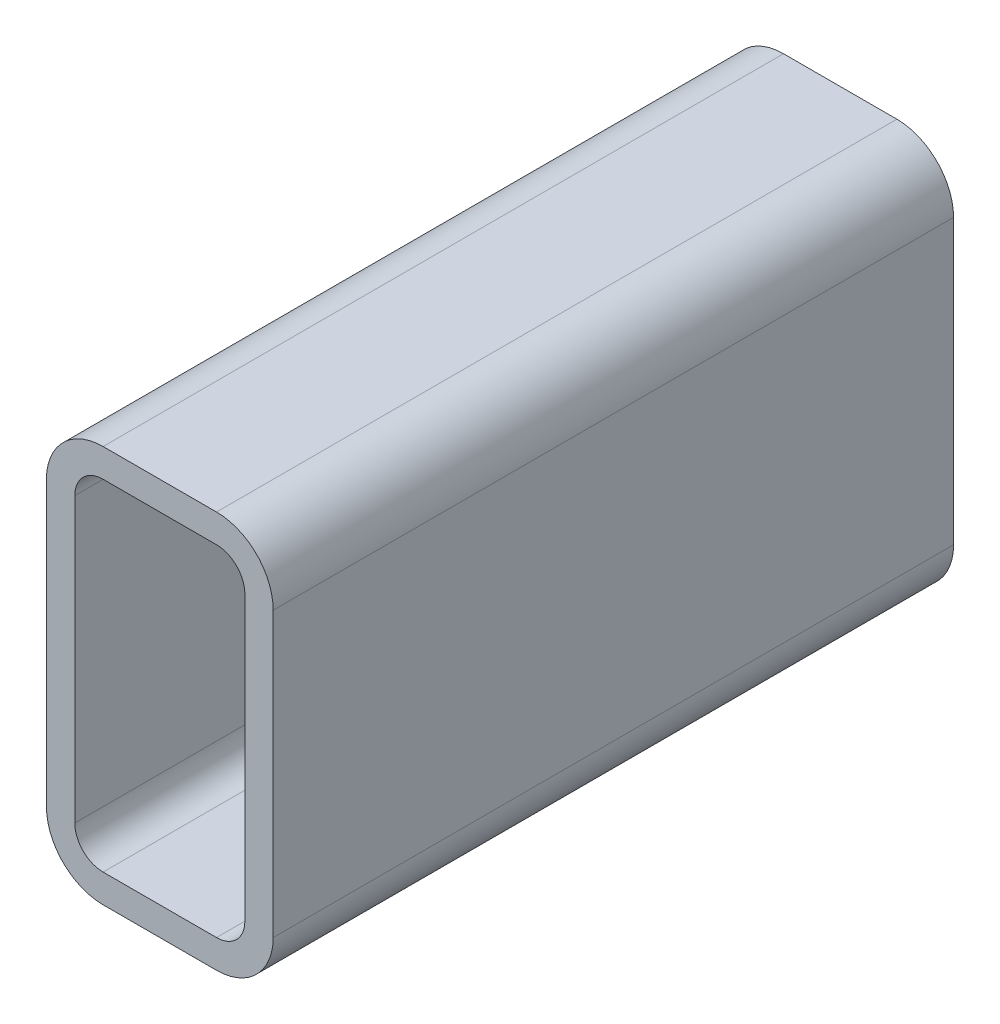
ISO-10303-21;
HEADER;
FILE_DESCRIPTION(('STEP AP214'),'2;1');
FILE_NAME('part.step','',(''),(''),'','','');
FILE_SCHEMA(('AUTOMOTIVE_DESIGN { 1 0 10303 214 1 1 1 1 }'));
ENDSEC;
DATA;
#1=APPLICATION_CONTEXT('core data for automotive mechanical design processes');
#2=APPLICATION_PROTOCOL_DEFINITION('international standard','automotive_design',2000,#1);
#3=PRODUCT_CONTEXT('',#1,'mechanical');
#4=PRODUCT('Part','Part','',(#3));
#5=PRODUCT_RELATED_PRODUCT_CATEGORY('part','',(#4));
#6=PRODUCT_DEFINITION_FORMATION('','',#4);
#7=PRODUCT_DEFINITION_CONTEXT('part definition',#1,'design');
#8=PRODUCT_DEFINITION('design','',#6,#7);
#9=PRODUCT_DEFINITION_SHAPE('','',#8);
#10=(LENGTH_UNIT() NAMED_UNIT(*) SI_UNIT(.MILLI.,.METRE.));
#11=(NAMED_UNIT(*) PLANE_ANGLE_UNIT() SI_UNIT($,.RADIAN.));
#12=(NAMED_UNIT(*) SI_UNIT($,.STERADIAN.) SOLID_ANGLE_UNIT());
#13=UNCERTAINTY_MEASURE_WITH_UNIT(LENGTH_MEASURE(1.E-05),#10,'distance_accuracy_value','');
#14=(GEOMETRIC_REPRESENTATION_CONTEXT(3) GLOBAL_UNCERTAINTY_ASSIGNED_CONTEXT((#13)) GLOBAL_UNIT_ASSIGNED_CONTEXT((#10,
#11,#12)) REPRESENTATION_CONTEXT('',''));
#15=CARTESIAN_POINT('',(0.,0.,0.));
#16=DIRECTION('',(0.,0.,1.));
#17=DIRECTION('',(1.,0.,0.));
#18=AXIS2_PLACEMENT_3D('',#15,#16,#17);
#19=CARTESIAN_POINT('',(27.0751778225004,154.389039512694,304.8));
#20=DIRECTION('',(0.,0.,1.));
#21=DIRECTION('',(1.,0.,0.));
#22=AXIS2_PLACEMENT_3D('',#19,#20,#21);
#23=PLANE('',#22);
#24=CARTESIAN_POINT('',(27.0751778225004,154.389039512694,304.8));
#25=DIRECTION('',(0.,0.,1.));
#26=DIRECTION('',(1.,0.,0.));
#27=AXIS2_PLACEMENT_3D('',#24,#25,#26);
#28=CIRCLE('',#27,25.4);
#29=CARTESIAN_POINT('',(27.0751778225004,179.789039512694,304.8));
#30=VERTEX_POINT('',#29);
#31=CARTESIAN_POINT('',(1.67517782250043,154.389039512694,304.8));
#32=VERTEX_POINT('',#31);
#33=EDGE_CURVE('E211',#30,#32,#28,.T.);
#34=ORIENTED_EDGE('',*,*,#33,.T.);
#35=DIRECTION('',(0.,-1.,0.));
#36=VECTOR('',#35,1.);
#37=CARTESIAN_POINT('',(1.67517782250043,27.3890395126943,304.8));
#38=LINE('',#37,#36);
#39=CARTESIAN_POINT('',(1.67517782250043,27.3890395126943,304.8));
#40=VERTEX_POINT('',#39);
#41=EDGE_CURVE('E214',#32,#40,#38,.T.);
#42=ORIENTED_EDGE('',*,*,#41,.T.);
#43=CARTESIAN_POINT('',(27.0751778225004,27.3890395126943,304.8));
#44=DIRECTION('',(0.,0.,1.));
#45=DIRECTION('',(1.,0.,0.));
#46=AXIS2_PLACEMENT_3D('',#43,#44,#45);
#47=CIRCLE('',#46,25.4);
#48=CARTESIAN_POINT('',(27.0751778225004,1.98903951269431,304.8));
#49=VERTEX_POINT('',#48);
#50=EDGE_CURVE('E217',#40,#49,#47,.T.);
#51=ORIENTED_EDGE('',*,*,#50,.T.);
#52=DIRECTION('',(1.,0.,0.));
#53=VECTOR('',#52,1.);
#54=CARTESIAN_POINT('',(77.8751778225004,1.98903951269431,304.8));
#55=LINE('',#54,#53);
#56=CARTESIAN_POINT('',(77.8751778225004,1.98903951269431,304.8));
#57=VERTEX_POINT('',#56);
#58=EDGE_CURVE('E219',#49,#57,#55,.T.);
#59=ORIENTED_EDGE('',*,*,#58,.T.);
#60=CARTESIAN_POINT('',(77.8751778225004,27.3890395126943,304.8));
#61=DIRECTION('',(0.,0.,1.));
#62=DIRECTION('',(1.,0.,0.));
#63=AXIS2_PLACEMENT_3D('',#60,#61,#62);
#64=CIRCLE('',#63,25.4);
#65=CARTESIAN_POINT('',(103.2751778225,27.3890395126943,304.8));
#66=VERTEX_POINT('',#65);
#67=EDGE_CURVE('E221',#57,#66,#64,.T.);
#68=ORIENTED_EDGE('',*,*,#67,.T.);
#69=DIRECTION('',(0.,1.,0.));
#70=VECTOR('',#69,1.);
#71=CARTESIAN_POINT('',(103.2751778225,154.389039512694,304.8));
#72=LINE('',#71,#70);
#73=CARTESIAN_POINT('',(103.2751778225,154.389039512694,304.8));
#74=VERTEX_POINT('',#73);
#75=EDGE_CURVE('E223',#66,#74,#72,.T.);
#76=ORIENTED_EDGE('',*,*,#75,.T.);
#77=CARTESIAN_POINT('',(77.8751778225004,154.389039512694,304.8));
#78=DIRECTION('',(0.,0.,1.));
#79=DIRECTION('',(1.,0.,0.));
#80=AXIS2_PLACEMENT_3D('',#77,#78,#79);
#81=CIRCLE('',#80,25.4);
#82=CARTESIAN_POINT('',(77.8751778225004,179.789039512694,304.8));
#83=VERTEX_POINT('',#82);
#84=EDGE_CURVE('E225',#74,#83,#81,.T.);
#85=ORIENTED_EDGE('',*,*,#84,.T.);
#86=DIRECTION('',(-1.,0.,0.));
#87=VECTOR('',#86,1.);
#88=CARTESIAN_POINT('',(27.0751778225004,179.789039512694,304.8));
#89=LINE('',#88,#87);
#90=EDGE_CURVE('E227',#83,#30,#89,.T.);
#91=ORIENTED_EDGE('',*,*,#90,.T.);
#92=EDGE_LOOP('',(#34,#42,#51,#59,#68,#76,#85,#91));
#93=FACE_BOUND('',#92,.T.);
#94=DIRECTION('',(0.,-1.,0.));
#95=VECTOR('',#94,1.);
#96=CARTESIAN_POINT('',(14.3751778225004,27.3890395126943,304.8));
#97=LINE('',#96,#95);
#98=CARTESIAN_POINT('',(14.3751778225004,154.389039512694,304.8));
#99=VERTEX_POINT('',#98);
#100=CARTESIAN_POINT('',(14.3751778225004,27.3890395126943,304.8));
#101=VERTEX_POINT('',#100);
#102=EDGE_CURVE('E154',#99,#101,#97,.T.);
#103=ORIENTED_EDGE('',*,*,#102,.F.);
#104=CARTESIAN_POINT('',(27.0751778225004,154.389039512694,304.8));
#105=DIRECTION('',(0.,0.,1.));
#106=DIRECTION('',(1.,0.,0.));
#107=AXIS2_PLACEMENT_3D('',#104,#105,#106);
#108=CIRCLE('',#107,12.7);
#109=CARTESIAN_POINT('',(27.0751778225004,167.089039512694,304.8));
#110=VERTEX_POINT('',#109);
#111=EDGE_CURVE('E146',#110,#99,#108,.T.);
#112=ORIENTED_EDGE('',*,*,#111,.F.);
#113=DIRECTION('',(-1.,0.,0.));
#114=VECTOR('',#113,1.);
#115=CARTESIAN_POINT('',(27.0751778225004,167.089039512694,304.8));
#116=LINE('',#115,#114);
#117=CARTESIAN_POINT('',(77.8751778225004,167.089039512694,304.8));
#118=VERTEX_POINT('',#117);
#119=EDGE_CURVE('E179',#118,#110,#116,.T.);
#120=ORIENTED_EDGE('',*,*,#119,.F.);
#121=CARTESIAN_POINT('',(77.8751778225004,154.389039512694,304.8));
#122=DIRECTION('',(0.,0.,1.));
#123=DIRECTION('',(1.,0.,0.));
#124=AXIS2_PLACEMENT_3D('',#121,#122,#123);
#125=CIRCLE('',#124,12.7);
#126=CARTESIAN_POINT('',(90.5751778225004,154.389039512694,304.8));
#127=VERTEX_POINT('',#126);
#128=EDGE_CURVE('E177',#127,#118,#125,.T.);
#129=ORIENTED_EDGE('',*,*,#128,.F.);
#130=DIRECTION('',(0.,1.,0.));
#131=VECTOR('',#130,1.);
#132=CARTESIAN_POINT('',(90.5751778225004,154.389039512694,304.8));
#133=LINE('',#132,#131);
#134=CARTESIAN_POINT('',(90.5751778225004,27.3890395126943,304.8));
#135=VERTEX_POINT('',#134);
#136=EDGE_CURVE('E175',#135,#127,#133,.T.);
#137=ORIENTED_EDGE('',*,*,#136,.F.);
#138=CARTESIAN_POINT('',(77.8751778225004,27.3890395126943,304.8));
#139=DIRECTION('',(0.,0.,1.));
#140=DIRECTION('',(1.,0.,0.));
#141=AXIS2_PLACEMENT_3D('',#138,#139,#140);
#142=CIRCLE('',#141,12.7);
#143=CARTESIAN_POINT('',(77.8751778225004,14.6890395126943,304.8));
#144=VERTEX_POINT('',#143);
#145=EDGE_CURVE('E173',#144,#135,#142,.T.);
#146=ORIENTED_EDGE('',*,*,#145,.F.);
#147=DIRECTION('',(1.,0.,0.));
#148=VECTOR('',#147,1.);
#149=CARTESIAN_POINT('',(77.8751778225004,14.6890395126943,304.8));
#150=LINE('',#149,#148);
#151=CARTESIAN_POINT('',(27.0751778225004,14.6890395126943,304.8));
#152=VERTEX_POINT('',#151);
#153=EDGE_CURVE('E169',#152,#144,#150,.T.);
#154=ORIENTED_EDGE('',*,*,#153,.F.);
#155=CARTESIAN_POINT('',(27.0751778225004,27.3890395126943,304.8));
#156=DIRECTION('',(0.,0.,1.));
#157=DIRECTION('',(1.,0.,0.));
#158=AXIS2_PLACEMENT_3D('',#155,#156,#157);
#159=CIRCLE('',#158,12.7);
#160=EDGE_CURVE('E167',#101,#152,#159,.T.);
#161=ORIENTED_EDGE('',*,*,#160,.F.);
#162=EDGE_LOOP('',(#103,#112,#120,#129,#137,#146,#154,#161));
#163=FACE_BOUND('',#162,.T.);
#164=ADVANCED_FACE('F33',(#93,#163),#23,.T.);
#165=CARTESIAN_POINT('',(27.0751778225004,154.389039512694,0.));
#166=DIRECTION('',(0.,0.,1.));
#167=DIRECTION('',(1.,0.,0.));
#168=AXIS2_PLACEMENT_3D('',#165,#166,#167);
#169=PLANE('',#168);
#170=CARTESIAN_POINT('',(27.0751778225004,154.389039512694,0.));
#171=DIRECTION('',(0.,0.,1.));
#172=DIRECTION('',(1.,0.,0.));
#173=AXIS2_PLACEMENT_3D('',#170,#171,#172);
#174=CIRCLE('',#173,25.4);
#175=CARTESIAN_POINT('',(27.0751778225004,179.789039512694,0.));
#176=VERTEX_POINT('',#175);
#177=CARTESIAN_POINT('',(1.67517782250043,154.389039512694,0.));
#178=VERTEX_POINT('',#177);
#179=EDGE_CURVE('E162',#176,#178,#174,.T.);
#180=ORIENTED_EDGE('',*,*,#179,.F.);
#181=DIRECTION('',(-1.,0.,0.));
#182=VECTOR('',#181,1.);
#183=CARTESIAN_POINT('',(27.0751778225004,179.789039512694,0.));
#184=LINE('',#183,#182);
#185=CARTESIAN_POINT('',(77.8751778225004,179.789039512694,0.));
#186=VERTEX_POINT('',#185);
#187=EDGE_CURVE('E215',#186,#176,#184,.T.);
#188=ORIENTED_EDGE('',*,*,#187,.F.);
#189=CARTESIAN_POINT('',(77.8751778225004,154.389039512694,0.));
#190=DIRECTION('',(0.,0.,1.));
#191=DIRECTION('',(1.,0.,0.));
#192=AXIS2_PLACEMENT_3D('',#189,#190,#191);
#193=CIRCLE('',#192,25.4);
#194=CARTESIAN_POINT('',(103.2751778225,154.389039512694,0.));
#195=VERTEX_POINT('',#194);
#196=EDGE_CURVE('E242',#195,#186,#193,.T.);
#197=ORIENTED_EDGE('',*,*,#196,.F.);
#198=DIRECTION('',(0.,1.,0.));
#199=VECTOR('',#198,1.);
#200=CARTESIAN_POINT('',(103.2751778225,154.389039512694,0.));
#201=LINE('',#200,#199);
#202=CARTESIAN_POINT('',(103.2751778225,27.3890395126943,0.));
#203=VERTEX_POINT('',#202);
#204=EDGE_CURVE('E240',#203,#195,#201,.T.);
#205=ORIENTED_EDGE('',*,*,#204,.F.);
#206=CARTESIAN_POINT('',(77.8751778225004,27.3890395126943,0.));
#207=DIRECTION('',(0.,0.,1.));
#208=DIRECTION('',(1.,0.,0.));
#209=AXIS2_PLACEMENT_3D('',#206,#207,#208);
#210=CIRCLE('',#209,25.4);
#211=CARTESIAN_POINT('',(77.8751778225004,1.98903951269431,0.));
#212=VERTEX_POINT('',#211);
#213=EDGE_CURVE('E238',#212,#203,#210,.T.);
#214=ORIENTED_EDGE('',*,*,#213,.F.);
#215=DIRECTION('',(1.,0.,0.));
#216=VECTOR('',#215,1.);
#217=CARTESIAN_POINT('',(77.8751778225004,1.98903951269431,0.));
#218=LINE('',#217,#216);
#219=CARTESIAN_POINT('',(27.0751778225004,1.98903951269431,0.));
#220=VERTEX_POINT('',#219);
#221=EDGE_CURVE('E236',#220,#212,#218,.T.);
#222=ORIENTED_EDGE('',*,*,#221,.F.);
#223=CARTESIAN_POINT('',(27.0751778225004,27.3890395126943,0.));
#224=DIRECTION('',(0.,0.,1.));
#225=DIRECTION('',(1.,0.,0.));
#226=AXIS2_PLACEMENT_3D('',#223,#224,#225);
#227=CIRCLE('',#226,25.4);
#228=CARTESIAN_POINT('',(1.67517782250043,27.3890395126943,0.));
#229=VERTEX_POINT('',#228);
#230=EDGE_CURVE('E234',#229,#220,#227,.T.);
#231=ORIENTED_EDGE('',*,*,#230,.F.);
#232=DIRECTION('',(0.,-1.,0.));
#233=VECTOR('',#232,1.);
#234=CARTESIAN_POINT('',(1.67517782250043,27.3890395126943,0.));
#235=LINE('',#234,#233);
#236=EDGE_CURVE('E232',#178,#229,#235,.T.);
#237=ORIENTED_EDGE('',*,*,#236,.F.);
#238=EDGE_LOOP('',(#180,#188,#197,#205,#214,#222,#231,#237));
#239=FACE_BOUND('',#238,.T.);
#240=CARTESIAN_POINT('',(27.0751778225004,154.389039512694,0.));
#241=DIRECTION('',(0.,0.,1.));
#242=DIRECTION('',(1.,0.,0.));
#243=AXIS2_PLACEMENT_3D('',#240,#241,#242);
#244=CIRCLE('',#243,12.7);
#245=CARTESIAN_POINT('',(27.0751778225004,167.089039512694,0.));
#246=VERTEX_POINT('',#245);
#247=CARTESIAN_POINT('',(14.3751778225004,154.389039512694,0.));
#248=VERTEX_POINT('',#247);
#249=EDGE_CURVE('E56',#246,#248,#244,.T.);
#250=ORIENTED_EDGE('',*,*,#249,.T.);
#251=DIRECTION('',(0.,-1.,0.));
#252=VECTOR('',#251,1.);
#253=CARTESIAN_POINT('',(14.3751778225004,27.3890395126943,0.));
#254=LINE('',#253,#252);
#255=CARTESIAN_POINT('',(14.3751778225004,27.3890395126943,0.));
#256=VERTEX_POINT('',#255);
#257=EDGE_CURVE('E161',#248,#256,#254,.T.);
#258=ORIENTED_EDGE('',*,*,#257,.T.);
#259=CARTESIAN_POINT('',(27.0751778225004,27.3890395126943,0.));
#260=DIRECTION('',(0.,0.,1.));
#261=DIRECTION('',(1.,0.,0.));
#262=AXIS2_PLACEMENT_3D('',#259,#260,#261);
#263=CIRCLE('',#262,12.7);
#264=CARTESIAN_POINT('',(27.0751778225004,14.6890395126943,0.));
#265=VERTEX_POINT('',#264);
#266=EDGE_CURVE('E183',#256,#265,#263,.T.);
#267=ORIENTED_EDGE('',*,*,#266,.T.);
#268=DIRECTION('',(1.,0.,0.));
#269=VECTOR('',#268,1.);
#270=CARTESIAN_POINT('',(77.8751778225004,14.6890395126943,0.));
#271=LINE('',#270,#269);
#272=CARTESIAN_POINT('',(77.8751778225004,14.6890395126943,0.));
#273=VERTEX_POINT('',#272);
#274=EDGE_CURVE('E186',#265,#273,#271,.T.);
#275=ORIENTED_EDGE('',*,*,#274,.T.);
#276=CARTESIAN_POINT('',(77.8751778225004,27.3890395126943,0.));
#277=DIRECTION('',(0.,0.,1.));
#278=DIRECTION('',(1.,0.,0.));
#279=AXIS2_PLACEMENT_3D('',#276,#277,#278);
#280=CIRCLE('',#279,12.7);
#281=CARTESIAN_POINT('',(90.5751778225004,27.3890395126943,0.));
#282=VERTEX_POINT('',#281);
#283=EDGE_CURVE('E189',#273,#282,#280,.T.);
#284=ORIENTED_EDGE('',*,*,#283,.T.);
#285=DIRECTION('',(0.,1.,0.));
#286=VECTOR('',#285,1.);
#287=CARTESIAN_POINT('',(90.5751778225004,154.389039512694,0.));
#288=LINE('',#287,#286);
#289=CARTESIAN_POINT('',(90.5751778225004,154.389039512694,0.));
#290=VERTEX_POINT('',#289);
#291=EDGE_CURVE('E192',#282,#290,#288,.T.);
#292=ORIENTED_EDGE('',*,*,#291,.T.);
#293=CARTESIAN_POINT('',(77.8751778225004,154.389039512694,0.));
#294=DIRECTION('',(0.,0.,1.));
#295=DIRECTION('',(1.,0.,0.));
#296=AXIS2_PLACEMENT_3D('',#293,#294,#295);
#297=CIRCLE('',#296,12.7);
#298=CARTESIAN_POINT('',(77.8751778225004,167.089039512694,0.));
#299=VERTEX_POINT('',#298);
#300=EDGE_CURVE('E195',#290,#299,#297,.T.);
#301=ORIENTED_EDGE('',*,*,#300,.T.);
#302=DIRECTION('',(-1.,0.,0.));
#303=VECTOR('',#302,1.);
#304=CARTESIAN_POINT('',(27.0751778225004,167.089039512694,0.));
#305=LINE('',#304,#303);
#306=EDGE_CURVE('E155',#299,#246,#305,.T.);
#307=ORIENTED_EDGE('',*,*,#306,.T.);
#308=EDGE_LOOP('',(#250,#258,#267,#275,#284,#292,#301,#307));
#309=FACE_BOUND('',#308,.T.);
#310=ADVANCED_FACE('F272',(#239,#309),#169,.F.);
#311=CARTESIAN_POINT('',(27.0751778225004,154.389039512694,304.8));
#312=DIRECTION('',(0.,0.,-1.));
#313=DIRECTION('',(-1.,0.,0.));
#314=AXIS2_PLACEMENT_3D('',#311,#312,#313);
#315=CYLINDRICAL_SURFACE('',#314,25.4);
#316=ORIENTED_EDGE('',*,*,#179,.T.);
#317=DIRECTION('',(0.,0.,-1.));
#318=VECTOR('',#317,1.);
#319=CARTESIAN_POINT('',(1.67517782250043,154.389039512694,304.8));
#320=LINE('',#319,#318);
#321=EDGE_CURVE('E11',#32,#178,#320,.T.);
#322=ORIENTED_EDGE('',*,*,#321,.F.);
#323=ORIENTED_EDGE('',*,*,#33,.F.);
#324=DIRECTION('',(0.,0.,-1.));
#325=VECTOR('',#324,1.);
#326=CARTESIAN_POINT('',(27.0751778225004,179.789039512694,304.8));
#327=LINE('',#326,#325);
#328=EDGE_CURVE('E229',#30,#176,#327,.T.);
#329=ORIENTED_EDGE('',*,*,#328,.T.);
#330=EDGE_LOOP('',(#316,#322,#323,#329));
#331=FACE_BOUND('',#330,.T.);
#332=ADVANCED_FACE('F35',(#331),#315,.T.);
#333=CARTESIAN_POINT('',(1.67517782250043,27.3890395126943,304.8));
#334=DIRECTION('',(1.,0.,0.));
#335=DIRECTION('',(0.,0.,-1.));
#336=AXIS2_PLACEMENT_3D('',#333,#334,#335);
#337=PLANE('',#336);
#338=ORIENTED_EDGE('',*,*,#236,.T.);
#339=DIRECTION('',(0.,0.,-1.));
#340=VECTOR('',#339,1.);
#341=CARTESIAN_POINT('',(1.67517782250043,27.3890395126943,304.8));
#342=LINE('',#341,#340);
#343=EDGE_CURVE('E41',#40,#229,#342,.T.);
#344=ORIENTED_EDGE('',*,*,#343,.F.);
#345=ORIENTED_EDGE('',*,*,#41,.F.);
#346=ORIENTED_EDGE('',*,*,#321,.T.);
#347=EDGE_LOOP('',(#338,#344,#345,#346));
#348=FACE_BOUND('',#347,.T.);
#349=ADVANCED_FACE('F289',(#348),#337,.F.);
#350=CARTESIAN_POINT('',(27.0751778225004,27.3890395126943,304.8));
#351=DIRECTION('',(0.,0.,-1.));
#352=DIRECTION('',(-1.,0.,0.));
#353=AXIS2_PLACEMENT_3D('',#350,#351,#352);
#354=CYLINDRICAL_SURFACE('',#353,25.4);
#355=ORIENTED_EDGE('',*,*,#230,.T.);
#356=DIRECTION('',(0.,0.,-1.));
#357=VECTOR('',#356,1.);
#358=CARTESIAN_POINT('',(27.0751778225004,1.98903951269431,304.8));
#359=LINE('',#358,#357);
#360=EDGE_CURVE('E259',#49,#220,#359,.T.);
#361=ORIENTED_EDGE('',*,*,#360,.F.);
#362=ORIENTED_EDGE('',*,*,#50,.F.);
#363=ORIENTED_EDGE('',*,*,#343,.T.);
#364=EDGE_LOOP('',(#355,#361,#362,#363));
#365=FACE_BOUND('',#364,.T.);
#366=ADVANCED_FACE('F266',(#365),#354,.T.);
#367=CARTESIAN_POINT('',(77.8751778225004,1.98903951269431,304.8));
#368=DIRECTION('',(0.,1.,0.));
#369=DIRECTION('',(0.,0.,1.));
#370=AXIS2_PLACEMENT_3D('',#367,#368,#369);
#371=PLANE('',#370);
#372=ORIENTED_EDGE('',*,*,#221,.T.);
#373=DIRECTION('',(0.,0.,-1.));
#374=VECTOR('',#373,1.);
#375=CARTESIAN_POINT('',(77.8751778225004,1.98903951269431,304.8));
#376=LINE('',#375,#374);
#377=EDGE_CURVE('E256',#57,#212,#376,.T.);
#378=ORIENTED_EDGE('',*,*,#377,.F.);
#379=ORIENTED_EDGE('',*,*,#58,.F.);
#380=ORIENTED_EDGE('',*,*,#360,.T.);
#381=EDGE_LOOP('',(#372,#378,#379,#380));
#382=FACE_BOUND('',#381,.T.);
#383=ADVANCED_FACE('F278',(#382),#371,.F.);
#384=CARTESIAN_POINT('',(77.8751778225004,27.3890395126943,304.8));
#385=DIRECTION('',(0.,0.,-1.));
#386=DIRECTION('',(-1.,0.,0.));
#387=AXIS2_PLACEMENT_3D('',#384,#385,#386);
#388=CYLINDRICAL_SURFACE('',#387,25.4);
#389=ORIENTED_EDGE('',*,*,#213,.T.);
#390=DIRECTION('',(0.,0.,-1.));
#391=VECTOR('',#390,1.);
#392=CARTESIAN_POINT('',(103.2751778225,27.3890395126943,304.8));
#393=LINE('',#392,#391);
#394=EDGE_CURVE('E253',#66,#203,#393,.T.);
#395=ORIENTED_EDGE('',*,*,#394,.F.);
#396=ORIENTED_EDGE('',*,*,#67,.F.);
#397=ORIENTED_EDGE('',*,*,#377,.T.);
#398=EDGE_LOOP('',(#389,#395,#396,#397));
#399=FACE_BOUND('',#398,.T.);
#400=ADVANCED_FACE('F282',(#399),#388,.T.);
#401=CARTESIAN_POINT('',(103.2751778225,154.389039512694,304.8));
#402=DIRECTION('',(-1.,0.,0.));
#403=DIRECTION('',(0.,0.,1.));
#404=AXIS2_PLACEMENT_3D('',#401,#402,#403);
#405=PLANE('',#404);
#406=ORIENTED_EDGE('',*,*,#204,.T.);
#407=DIRECTION('',(0.,0.,-1.));
#408=VECTOR('',#407,1.);
#409=CARTESIAN_POINT('',(103.2751778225,154.389039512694,304.8));
#410=LINE('',#409,#408);
#411=EDGE_CURVE('E250',#74,#195,#410,.T.);
#412=ORIENTED_EDGE('',*,*,#411,.F.);
#413=ORIENTED_EDGE('',*,*,#75,.F.);
#414=ORIENTED_EDGE('',*,*,#394,.T.);
#415=EDGE_LOOP('',(#406,#412,#413,#414));
#416=FACE_BOUND('',#415,.T.);
#417=ADVANCED_FACE('F302',(#416),#405,.F.);
#418=CARTESIAN_POINT('',(77.8751778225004,154.389039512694,304.8));
#419=DIRECTION('',(0.,0.,-1.));
#420=DIRECTION('',(-1.,0.,0.));
#421=AXIS2_PLACEMENT_3D('',#418,#419,#420);
#422=CYLINDRICAL_SURFACE('',#421,25.4);
#423=ORIENTED_EDGE('',*,*,#196,.T.);
#424=DIRECTION('',(0.,0.,-1.));
#425=VECTOR('',#424,1.);
#426=CARTESIAN_POINT('',(77.8751778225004,179.789039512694,304.8));
#427=LINE('',#426,#425);
#428=EDGE_CURVE('E247',#83,#186,#427,.T.);
#429=ORIENTED_EDGE('',*,*,#428,.F.);
#430=ORIENTED_EDGE('',*,*,#84,.F.);
#431=ORIENTED_EDGE('',*,*,#411,.T.);
#432=EDGE_LOOP('',(#423,#429,#430,#431));
#433=FACE_BOUND('',#432,.T.);
#434=ADVANCED_FACE('F300',(#433),#422,.T.);
#435=CARTESIAN_POINT('',(27.0751778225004,179.789039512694,304.8));
#436=DIRECTION('',(0.,-1.,0.));
#437=DIRECTION('',(0.,0.,-1.));
#438=AXIS2_PLACEMENT_3D('',#435,#436,#437);
#439=PLANE('',#438);
#440=ORIENTED_EDGE('',*,*,#187,.T.);
#441=ORIENTED_EDGE('',*,*,#328,.F.);
#442=ORIENTED_EDGE('',*,*,#90,.F.);
#443=ORIENTED_EDGE('',*,*,#428,.T.);
#444=EDGE_LOOP('',(#440,#441,#442,#443));
#445=FACE_BOUND('',#444,.T.);
#446=ADVANCED_FACE('F295',(#445),#439,.F.);
#447=CARTESIAN_POINT('',(27.0751778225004,154.389039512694,304.8));
#448=DIRECTION('',(0.,0.,-1.));
#449=DIRECTION('',(-1.,0.,0.));
#450=AXIS2_PLACEMENT_3D('',#447,#448,#449);
#451=CYLINDRICAL_SURFACE('',#450,12.7);
#452=ORIENTED_EDGE('',*,*,#249,.F.);
#453=DIRECTION('',(0.,0.,-1.));
#454=VECTOR('',#453,1.);
#455=CARTESIAN_POINT('',(27.0751778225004,167.089039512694,304.8));
#456=LINE('',#455,#454);
#457=EDGE_CURVE('E150',#110,#246,#456,.T.);
#458=ORIENTED_EDGE('',*,*,#457,.F.);
#459=ORIENTED_EDGE('',*,*,#111,.T.);
#460=DIRECTION('',(0.,0.,-1.));
#461=VECTOR('',#460,1.);
#462=CARTESIAN_POINT('',(14.3751778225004,154.389039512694,304.8));
#463=LINE('',#462,#461);
#464=EDGE_CURVE('E149',#99,#248,#463,.T.);
#465=ORIENTED_EDGE('',*,*,#464,.T.);
#466=EDGE_LOOP('',(#452,#458,#459,#465));
#467=FACE_BOUND('',#466,.T.);
#468=ADVANCED_FACE('F148',(#467),#451,.F.);
#469=CARTESIAN_POINT('',(14.3751778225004,27.3890395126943,304.8));
#470=DIRECTION('',(1.,0.,0.));
#471=DIRECTION('',(0.,0.,-1.));
#472=AXIS2_PLACEMENT_3D('',#469,#470,#471);
#473=PLANE('',#472);
#474=ORIENTED_EDGE('',*,*,#257,.F.);
#475=ORIENTED_EDGE('',*,*,#464,.F.);
#476=ORIENTED_EDGE('',*,*,#102,.T.);
#477=DIRECTION('',(0.,0.,-1.));
#478=VECTOR('',#477,1.);
#479=CARTESIAN_POINT('',(14.3751778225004,27.3890395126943,304.8));
#480=LINE('',#479,#478);
#481=EDGE_CURVE('E163',#101,#256,#480,.T.);
#482=ORIENTED_EDGE('',*,*,#481,.T.);
#483=EDGE_LOOP('',(#474,#475,#476,#482));
#484=FACE_BOUND('',#483,.T.);
#485=ADVANCED_FACE('F158',(#484),#473,.T.);
#486=CARTESIAN_POINT('',(27.0751778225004,27.3890395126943,304.8));
#487=DIRECTION('',(0.,0.,-1.));
#488=DIRECTION('',(-1.,0.,0.));
#489=AXIS2_PLACEMENT_3D('',#486,#487,#488);
#490=CYLINDRICAL_SURFACE('',#489,12.7);
#491=ORIENTED_EDGE('',*,*,#266,.F.);
#492=ORIENTED_EDGE('',*,*,#481,.F.);
#493=ORIENTED_EDGE('',*,*,#160,.T.);
#494=DIRECTION('',(0.,0.,-1.));
#495=VECTOR('',#494,1.);
#496=CARTESIAN_POINT('',(27.0751778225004,14.6890395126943,304.8));
#497=LINE('',#496,#495);
#498=EDGE_CURVE('E208',#152,#265,#497,.T.);
#499=ORIENTED_EDGE('',*,*,#498,.T.);
#500=EDGE_LOOP('',(#491,#492,#493,#499));
#501=FACE_BOUND('',#500,.T.);
#502=ADVANCED_FACE('F327',(#501),#490,.F.);
#503=CARTESIAN_POINT('',(77.8751778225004,14.6890395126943,304.8));
#504=DIRECTION('',(0.,1.,0.));
#505=DIRECTION('',(0.,0.,1.));
#506=AXIS2_PLACEMENT_3D('',#503,#504,#505);
#507=PLANE('',#506);
#508=ORIENTED_EDGE('',*,*,#274,.F.);
#509=ORIENTED_EDGE('',*,*,#498,.F.);
#510=ORIENTED_EDGE('',*,*,#153,.T.);
#511=DIRECTION('',(0.,0.,-1.));
#512=VECTOR('',#511,1.);
#513=CARTESIAN_POINT('',(77.8751778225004,14.6890395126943,304.8));
#514=LINE('',#513,#512);
#515=EDGE_CURVE('E206',#144,#273,#514,.T.);
#516=ORIENTED_EDGE('',*,*,#515,.T.);
#517=EDGE_LOOP('',(#508,#509,#510,#516));
#518=FACE_BOUND('',#517,.T.);
#519=ADVANCED_FACE('F331',(#518),#507,.T.);
#520=CARTESIAN_POINT('',(77.8751778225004,27.3890395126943,304.8));
#521=DIRECTION('',(0.,0.,-1.));
#522=DIRECTION('',(-1.,0.,0.));
#523=AXIS2_PLACEMENT_3D('',#520,#521,#522);
#524=CYLINDRICAL_SURFACE('',#523,12.7);
#525=ORIENTED_EDGE('',*,*,#283,.F.);
#526=ORIENTED_EDGE('',*,*,#515,.F.);
#527=ORIENTED_EDGE('',*,*,#145,.T.);
#528=DIRECTION('',(0.,0.,-1.));
#529=VECTOR('',#528,1.);
#530=CARTESIAN_POINT('',(90.5751778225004,27.3890395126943,304.8));
#531=LINE('',#530,#529);
#532=EDGE_CURVE('E204',#135,#282,#531,.T.);
#533=ORIENTED_EDGE('',*,*,#532,.T.);
#534=EDGE_LOOP('',(#525,#526,#527,#533));
#535=FACE_BOUND('',#534,.T.);
#536=ADVANCED_FACE('F337',(#535),#524,.F.);
#537=CARTESIAN_POINT('',(90.5751778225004,154.389039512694,304.8));
#538=DIRECTION('',(-1.,0.,0.));
#539=DIRECTION('',(0.,0.,1.));
#540=AXIS2_PLACEMENT_3D('',#537,#538,#539);
#541=PLANE('',#540);
#542=ORIENTED_EDGE('',*,*,#291,.F.);
#543=ORIENTED_EDGE('',*,*,#532,.F.);
#544=ORIENTED_EDGE('',*,*,#136,.T.);
#545=DIRECTION('',(0.,0.,-1.));
#546=VECTOR('',#545,1.);
#547=CARTESIAN_POINT('',(90.5751778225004,154.389039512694,304.8));
#548=LINE('',#547,#546);
#549=EDGE_CURVE('E202',#127,#290,#548,.T.);
#550=ORIENTED_EDGE('',*,*,#549,.T.);
#551=EDGE_LOOP('',(#542,#543,#544,#550));
#552=FACE_BOUND('',#551,.T.);
#553=ADVANCED_FACE('F341',(#552),#541,.T.);
#554=CARTESIAN_POINT('',(77.8751778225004,154.389039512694,304.8));
#555=DIRECTION('',(0.,0.,-1.));
#556=DIRECTION('',(-1.,0.,0.));
#557=AXIS2_PLACEMENT_3D('',#554,#555,#556);
#558=CYLINDRICAL_SURFACE('',#557,12.7);
#559=ORIENTED_EDGE('',*,*,#300,.F.);
#560=ORIENTED_EDGE('',*,*,#549,.F.);
#561=ORIENTED_EDGE('',*,*,#128,.T.);
#562=DIRECTION('',(0.,0.,-1.));
#563=VECTOR('',#562,1.);
#564=CARTESIAN_POINT('',(77.8751778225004,167.089039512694,304.8));
#565=LINE('',#564,#563);
#566=EDGE_CURVE('E48',#118,#299,#565,.T.);
#567=ORIENTED_EDGE('',*,*,#566,.T.);
#568=EDGE_LOOP('',(#559,#560,#561,#567));
#569=FACE_BOUND('',#568,.T.);
#570=ADVANCED_FACE('F345',(#569),#558,.F.);
#571=CARTESIAN_POINT('',(27.0751778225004,167.089039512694,304.8));
#572=DIRECTION('',(0.,-1.,0.));
#573=DIRECTION('',(0.,0.,-1.));
#574=AXIS2_PLACEMENT_3D('',#571,#572,#573);
#575=PLANE('',#574);
#576=ORIENTED_EDGE('',*,*,#306,.F.);
#577=ORIENTED_EDGE('',*,*,#566,.F.);
#578=ORIENTED_EDGE('',*,*,#119,.T.);
#579=ORIENTED_EDGE('',*,*,#457,.T.);
#580=EDGE_LOOP('',(#576,#577,#578,#579));
#581=FACE_BOUND('',#580,.T.);
#582=ADVANCED_FACE('F349',(#581),#575,.T.);
#583=CLOSED_SHELL('',(#164,#310,#332,#349,#366,#383,#400,#417,#434,#446,#468,#485,#502,#519,
#536,#553,#570,#582));
#584=MANIFOLD_SOLID_BREP('B2',#583);
#585=ADVANCED_BREP_SHAPE_REPRESENTATION('',(#18,#584),#14);
#586=SHAPE_DEFINITION_REPRESENTATION(#9,#585);
ENDSEC;
END-ISO-10303-21;
